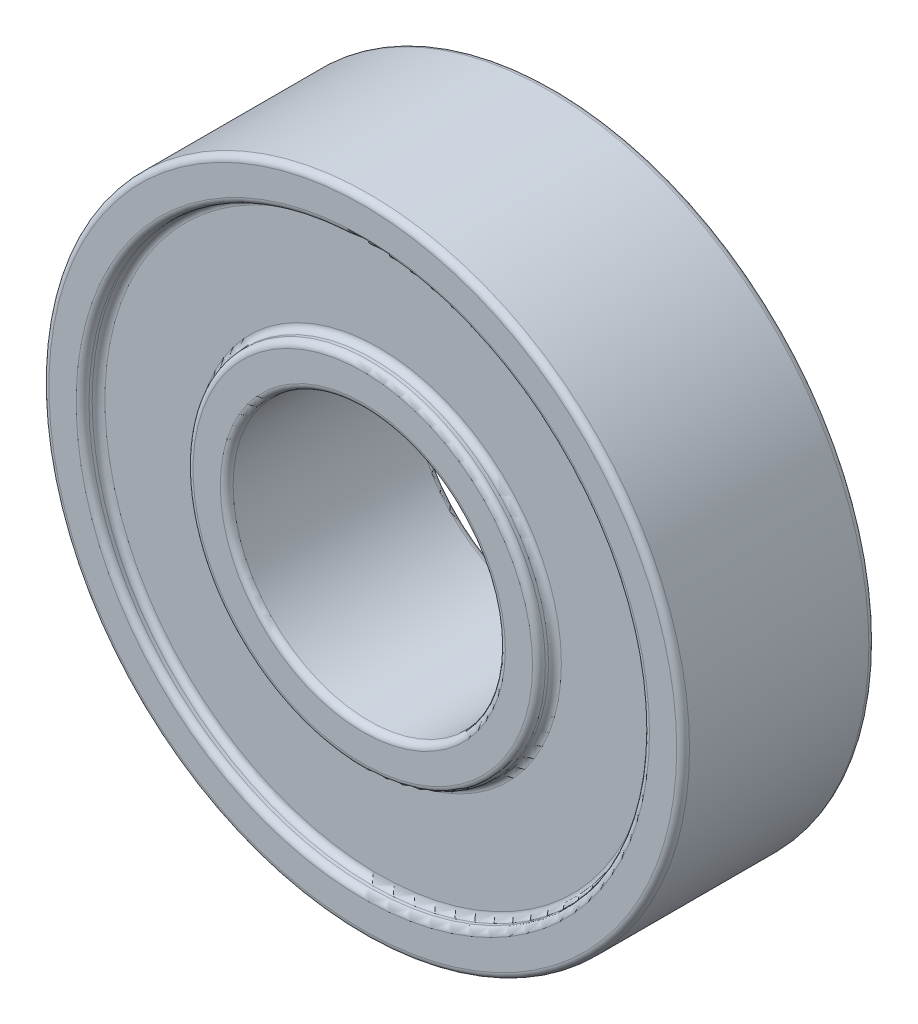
ISO-10303-21;
HEADER;
FILE_DESCRIPTION(('STEP AP214'),'2;1');
FILE_NAME('part.step','',(''),(''),'','','');
FILE_SCHEMA(('AUTOMOTIVE_DESIGN { 1 0 10303 214 1 1 1 1 }'));
ENDSEC;
DATA;
#1=APPLICATION_CONTEXT('core data for automotive mechanical design processes');
#2=APPLICATION_PROTOCOL_DEFINITION('international standard','automotive_design',2000,#1);
#3=PRODUCT_CONTEXT('',#1,'mechanical');
#4=PRODUCT('Part','Part','',(#3));
#5=PRODUCT_RELATED_PRODUCT_CATEGORY('part','',(#4));
#6=PRODUCT_DEFINITION_FORMATION('','',#4);
#7=PRODUCT_DEFINITION_CONTEXT('part definition',#1,'design');
#8=PRODUCT_DEFINITION('design','',#6,#7);
#9=PRODUCT_DEFINITION_SHAPE('','',#8);
#10=(LENGTH_UNIT() NAMED_UNIT(*) SI_UNIT(.MILLI.,.METRE.));
#11=(NAMED_UNIT(*) PLANE_ANGLE_UNIT() SI_UNIT($,.RADIAN.));
#12=(NAMED_UNIT(*) SI_UNIT($,.STERADIAN.) SOLID_ANGLE_UNIT());
#13=UNCERTAINTY_MEASURE_WITH_UNIT(LENGTH_MEASURE(1.E-05),#10,'distance_accuracy_value','');
#14=(GEOMETRIC_REPRESENTATION_CONTEXT(3) GLOBAL_UNCERTAINTY_ASSIGNED_CONTEXT((#13)) GLOBAL_UNIT_ASSIGNED_CONTEXT((#10,
#11,#12)) REPRESENTATION_CONTEXT('',''));
#15=CARTESIAN_POINT('',(0.,0.,0.));
#16=DIRECTION('',(0.,0.,1.));
#17=DIRECTION('',(1.,0.,0.));
#18=AXIS2_PLACEMENT_3D('',#15,#16,#17);
#19=CARTESIAN_POINT('',(0.,0.,0.));
#20=DIRECTION('',(0.,0.,1.));
#21=DIRECTION('',(1.,0.,0.));
#22=AXIS2_PLACEMENT_3D('',#19,#20,#21);
#23=PLANE('',#22);
#24=CARTESIAN_POINT('',(0.118835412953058,0.178253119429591,0.));
#25=DIRECTION('',(0.,0.,1.));
#26=DIRECTION('',(1.,0.,0.));
#27=AXIS2_PLACEMENT_3D('',#24,#25,#26);
#28=CIRCLE('',#27,10.6);
#29=CARTESIAN_POINT('',(10.7188354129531,0.178253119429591,0.));
#30=VERTEX_POINT('',#29);
#31=EDGE_CURVE('E74',#30,#30,#28,.F.);
#32=ORIENTED_EDGE('',*,*,#31,.T.);
#33=EDGE_LOOP('',(#32));
#34=FACE_BOUND('',#33,.T.);
#35=CARTESIAN_POINT('',(0.,0.,0.));
#36=DIRECTION('',(0.,0.,1.));
#37=DIRECTION('',(1.,0.,0.));
#38=AXIS2_PLACEMENT_3D('',#35,#36,#37);
#39=CIRCLE('',#38,8.9);
#40=CARTESIAN_POINT('',(8.9,0.,0.));
#41=VERTEX_POINT('',#40);
#42=EDGE_CURVE('E77',#41,#41,#39,.T.);
#43=ORIENTED_EDGE('',*,*,#42,.T.);
#44=EDGE_LOOP('',(#43));
#45=FACE_BOUND('',#44,.T.);
#46=ADVANCED_FACE('F30',(#34,#45),#23,.F.);
#47=CARTESIAN_POINT('',(0.,0.,12.));
#48=DIRECTION('',(0.,0.,1.));
#49=DIRECTION('',(1.,0.,0.));
#50=AXIS2_PLACEMENT_3D('',#47,#48,#49);
#51=PLANE('',#50);
#52=CARTESIAN_POINT('',(0.,0.,12.));
#53=DIRECTION('',(0.,0.,1.));
#54=DIRECTION('',(1.,0.,0.));
#55=AXIS2_PLACEMENT_3D('',#52,#53,#54);
#56=CIRCLE('',#55,10.6);
#57=CARTESIAN_POINT('',(10.6,0.,12.));
#58=VERTEX_POINT('',#57);
#59=EDGE_CURVE('E104',#58,#58,#56,.T.);
#60=ORIENTED_EDGE('',*,*,#59,.T.);
#61=EDGE_LOOP('',(#60));
#62=FACE_BOUND('',#61,.T.);
#63=CARTESIAN_POINT('',(0.,0.,12.));
#64=DIRECTION('',(0.,0.,1.));
#65=DIRECTION('',(1.,0.,0.));
#66=AXIS2_PLACEMENT_3D('',#63,#64,#65);
#67=CIRCLE('',#66,8.9);
#68=CARTESIAN_POINT('',(8.9,0.,12.));
#69=VERTEX_POINT('',#68);
#70=EDGE_CURVE('E107',#69,#69,#67,.F.);
#71=ORIENTED_EDGE('',*,*,#70,.T.);
#72=EDGE_LOOP('',(#71));
#73=FACE_BOUND('',#72,.T.);
#74=ADVANCED_FACE('F111',(#62,#73),#51,.T.);
#75=CARTESIAN_POINT('',(0.,0.,12.));
#76=DIRECTION('',(0.,0.,1.));
#77=DIRECTION('',(1.,0.,0.));
#78=AXIS2_PLACEMENT_3D('',#75,#76,#77);
#79=CIRCLE('',#78,17.9);
#80=CARTESIAN_POINT('',(17.9,0.,12.));
#81=VERTEX_POINT('',#80);
#82=EDGE_CURVE('E80',#81,#81,#79,.F.);
#83=ORIENTED_EDGE('',*,*,#82,.T.);
#84=EDGE_LOOP('',(#83));
#85=FACE_BOUND('',#84,.T.);
#86=CARTESIAN_POINT('',(0.,0.,12.));
#87=DIRECTION('',(0.,0.,1.));
#88=DIRECTION('',(1.,0.,0.));
#89=AXIS2_PLACEMENT_3D('',#86,#87,#88);
#90=CIRCLE('',#89,19.6);
#91=CARTESIAN_POINT('',(19.6,0.,12.));
#92=VERTEX_POINT('',#91);
#93=EDGE_CURVE('E83',#92,#92,#90,.T.);
#94=ORIENTED_EDGE('',*,*,#93,.T.);
#95=EDGE_LOOP('',(#94));
#96=FACE_BOUND('',#95,.T.);
#97=ADVANCED_FACE('F140',(#85,#96),#51,.T.);
#98=CARTESIAN_POINT('',(0.,0.,0.));
#99=DIRECTION('',(0.,0.,1.));
#100=DIRECTION('',(1.,0.,0.));
#101=AXIS2_PLACEMENT_3D('',#98,#99,#100);
#102=CIRCLE('',#101,17.9);
#103=CARTESIAN_POINT('',(17.9,0.,0.));
#104=VERTEX_POINT('',#103);
#105=EDGE_CURVE('E50',#104,#104,#102,.T.);
#106=ORIENTED_EDGE('',*,*,#105,.T.);
#107=EDGE_LOOP('',(#106));
#108=FACE_BOUND('',#107,.T.);
#109=CARTESIAN_POINT('',(0.,0.,0.));
#110=DIRECTION('',(0.,0.,1.));
#111=DIRECTION('',(1.,0.,0.));
#112=AXIS2_PLACEMENT_3D('',#109,#110,#111);
#113=CIRCLE('',#112,19.6);
#114=CARTESIAN_POINT('',(19.6,0.,0.));
#115=VERTEX_POINT('',#114);
#116=EDGE_CURVE('E53',#115,#115,#113,.F.);
#117=ORIENTED_EDGE('',*,*,#116,.T.);
#118=EDGE_LOOP('',(#117));
#119=FACE_BOUND('',#118,.T.);
#120=ADVANCED_FACE('F133',(#108,#119),#23,.F.);
#121=CARTESIAN_POINT('',(0.,0.,12.));
#122=DIRECTION('',(0.,0.,-1.));
#123=DIRECTION('',(-1.,0.,0.));
#124=AXIS2_PLACEMENT_3D('',#121,#122,#123);
#125=CYLINDRICAL_SURFACE('',#124,20.);
#126=CARTESIAN_POINT('',(0.,0.,0.399999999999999));
#127=DIRECTION('',(0.,0.,1.));
#128=DIRECTION('',(1.,0.,0.));
#129=AXIS2_PLACEMENT_3D('',#126,#127,#128);
#130=CIRCLE('',#129,20.);
#131=CARTESIAN_POINT('',(20.,0.,0.399999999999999));
#132=VERTEX_POINT('',#131);
#133=EDGE_CURVE('E10',#132,#132,#130,.T.);
#134=ORIENTED_EDGE('',*,*,#133,.T.);
#135=EDGE_LOOP('',(#134));
#136=FACE_BOUND('',#135,.T.);
#137=CARTESIAN_POINT('',(0.,0.,11.6));
#138=DIRECTION('',(0.,0.,1.));
#139=DIRECTION('',(1.,0.,0.));
#140=AXIS2_PLACEMENT_3D('',#137,#138,#139);
#141=CIRCLE('',#140,20.);
#142=CARTESIAN_POINT('',(20.,0.,11.6));
#143=VERTEX_POINT('',#142);
#144=EDGE_CURVE('E37',#143,#143,#141,.F.);
#145=ORIENTED_EDGE('',*,*,#144,.T.);
#146=EDGE_LOOP('',(#145));
#147=FACE_BOUND('',#146,.T.);
#148=ADVANCED_FACE('F32',(#136,#147),#125,.T.);
#149=CARTESIAN_POINT('',(0.,0.,12.));
#150=DIRECTION('',(0.,0.,-1.));
#151=DIRECTION('',(-1.,0.,0.));
#152=AXIS2_PLACEMENT_3D('',#149,#150,#151);
#153=CYLINDRICAL_SURFACE('',#152,8.5);
#154=CARTESIAN_POINT('',(0.,0.,0.399999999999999));
#155=DIRECTION('',(0.,0.,1.));
#156=DIRECTION('',(1.,0.,0.));
#157=AXIS2_PLACEMENT_3D('',#154,#155,#156);
#158=CIRCLE('',#157,8.5);
#159=CARTESIAN_POINT('',(8.5,0.,0.399999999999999));
#160=VERTEX_POINT('',#159);
#161=EDGE_CURVE('E41',#160,#160,#158,.F.);
#162=ORIENTED_EDGE('',*,*,#161,.T.);
#163=EDGE_LOOP('',(#162));
#164=FACE_BOUND('',#163,.T.);
#165=CARTESIAN_POINT('',(0.,0.,11.6));
#166=DIRECTION('',(0.,0.,1.));
#167=DIRECTION('',(1.,0.,0.));
#168=AXIS2_PLACEMENT_3D('',#165,#166,#167);
#169=CIRCLE('',#168,8.5);
#170=CARTESIAN_POINT('',(8.5,0.,11.6));
#171=VERTEX_POINT('',#170);
#172=EDGE_CURVE('E45',#171,#171,#169,.T.);
#173=ORIENTED_EDGE('',*,*,#172,.T.);
#174=EDGE_LOOP('',(#173));
#175=FACE_BOUND('',#174,.T.);
#176=ADVANCED_FACE('F121',(#164,#175),#153,.F.);
#177=CARTESIAN_POINT('',(0.,0.,11.));
#178=DIRECTION('',(0.,0.,1.));
#179=DIRECTION('',(1.,0.,0.));
#180=AXIS2_PLACEMENT_3D('',#177,#178,#179);
#181=CYLINDRICAL_SURFACE('',#180,17.5);
#182=CARTESIAN_POINT('',(0.,0.,11.6));
#183=DIRECTION('',(0.,0.,1.));
#184=DIRECTION('',(1.,0.,0.));
#185=AXIS2_PLACEMENT_3D('',#182,#183,#184);
#186=CIRCLE('',#185,17.5);
#187=CARTESIAN_POINT('',(17.5,0.,11.6));
#188=VERTEX_POINT('',#187);
#189=EDGE_CURVE('E86',#188,#188,#186,.T.);
#190=ORIENTED_EDGE('',*,*,#189,.T.);
#191=EDGE_LOOP('',(#190));
#192=FACE_BOUND('',#191,.T.);
#193=CARTESIAN_POINT('',(0.,0.,11.4));
#194=DIRECTION('',(0.,0.,1.));
#195=DIRECTION('',(1.,0.,0.));
#196=AXIS2_PLACEMENT_3D('',#193,#194,#195);
#197=CIRCLE('',#196,17.5);
#198=CARTESIAN_POINT('',(17.5,0.,11.4));
#199=VERTEX_POINT('',#198);
#200=EDGE_CURVE('E89',#199,#199,#197,.F.);
#201=ORIENTED_EDGE('',*,*,#200,.T.);
#202=EDGE_LOOP('',(#201));
#203=FACE_BOUND('',#202,.T.);
#204=ADVANCED_FACE('F123',(#192,#203),#181,.F.);
#205=CARTESIAN_POINT('',(0.,0.,11.));
#206=DIRECTION('',(0.,0.,1.));
#207=DIRECTION('',(1.,0.,0.));
#208=AXIS2_PLACEMENT_3D('',#205,#206,#207);
#209=PLANE('',#208);
#210=CARTESIAN_POINT('',(0.,0.,11.));
#211=DIRECTION('',(0.,0.,1.));
#212=DIRECTION('',(1.,0.,0.));
#213=AXIS2_PLACEMENT_3D('',#210,#211,#212);
#214=CIRCLE('',#213,11.4);
#215=CARTESIAN_POINT('',(11.4,0.,11.));
#216=VERTEX_POINT('',#215);
#217=EDGE_CURVE('E92',#216,#216,#214,.F.);
#218=ORIENTED_EDGE('',*,*,#217,.T.);
#219=EDGE_LOOP('',(#218));
#220=FACE_BOUND('',#219,.T.);
#221=CARTESIAN_POINT('',(0.,0.,11.));
#222=DIRECTION('',(0.,0.,1.));
#223=DIRECTION('',(1.,0.,0.));
#224=AXIS2_PLACEMENT_3D('',#221,#222,#223);
#225=CIRCLE('',#224,17.1);
#226=CARTESIAN_POINT('',(17.1,0.,11.));
#227=VERTEX_POINT('',#226);
#228=EDGE_CURVE('E95',#227,#227,#225,.T.);
#229=ORIENTED_EDGE('',*,*,#228,.T.);
#230=EDGE_LOOP('',(#229));
#231=FACE_BOUND('',#230,.T.);
#232=ADVANCED_FACE('F130',(#220,#231),#209,.T.);
#233=CARTESIAN_POINT('',(0.,0.,11.));
#234=DIRECTION('',(0.,0.,1.));
#235=DIRECTION('',(1.,0.,0.));
#236=AXIS2_PLACEMENT_3D('',#233,#234,#235);
#237=CYLINDRICAL_SURFACE('',#236,11.);
#238=CARTESIAN_POINT('',(0.,0.,11.6));
#239=DIRECTION('',(0.,0.,1.));
#240=DIRECTION('',(1.,0.,0.));
#241=AXIS2_PLACEMENT_3D('',#238,#239,#240);
#242=CIRCLE('',#241,11.);
#243=CARTESIAN_POINT('',(11.,0.,11.6));
#244=VERTEX_POINT('',#243);
#245=EDGE_CURVE('E98',#244,#244,#242,.F.);
#246=ORIENTED_EDGE('',*,*,#245,.T.);
#247=EDGE_LOOP('',(#246));
#248=FACE_BOUND('',#247,.T.);
#249=CARTESIAN_POINT('',(0.,0.,11.4));
#250=DIRECTION('',(0.,0.,1.));
#251=DIRECTION('',(1.,0.,0.));
#252=AXIS2_PLACEMENT_3D('',#249,#250,#251);
#253=CIRCLE('',#252,11.);
#254=CARTESIAN_POINT('',(11.,0.,11.4));
#255=VERTEX_POINT('',#254);
#256=EDGE_CURVE('E101',#255,#255,#253,.T.);
#257=ORIENTED_EDGE('',*,*,#256,.T.);
#258=EDGE_LOOP('',(#257));
#259=FACE_BOUND('',#258,.T.);
#260=ADVANCED_FACE('F209',(#248,#259),#237,.T.);
#261=CARTESIAN_POINT('',(0.,0.,1.));
#262=DIRECTION('',(0.,0.,-1.));
#263=DIRECTION('',(-1.,0.,0.));
#264=AXIS2_PLACEMENT_3D('',#261,#262,#263);
#265=CYLINDRICAL_SURFACE('',#264,17.5);
#266=CARTESIAN_POINT('',(0.,0.,0.4));
#267=DIRECTION('',(0.,0.,1.));
#268=DIRECTION('',(1.,0.,0.));
#269=AXIS2_PLACEMENT_3D('',#266,#267,#268);
#270=CIRCLE('',#269,17.5);
#271=CARTESIAN_POINT('',(17.5,0.,0.4));
#272=VERTEX_POINT('',#271);
#273=EDGE_CURVE('E56',#272,#272,#270,.F.);
#274=ORIENTED_EDGE('',*,*,#273,.T.);
#275=EDGE_LOOP('',(#274));
#276=FACE_BOUND('',#275,.T.);
#277=CARTESIAN_POINT('',(0.,0.,0.6));
#278=DIRECTION('',(0.,0.,-1.));
#279=DIRECTION('',(-1.,0.,0.));
#280=AXIS2_PLACEMENT_3D('',#277,#278,#279);
#281=CIRCLE('',#280,17.5);
#282=CARTESIAN_POINT('',(-17.5,0.,0.6));
#283=VERTEX_POINT('',#282);
#284=EDGE_CURVE('E59',#283,#283,#281,.F.);
#285=ORIENTED_EDGE('',*,*,#284,.T.);
#286=EDGE_LOOP('',(#285));
#287=FACE_BOUND('',#286,.T.);
#288=ADVANCED_FACE('F205',(#276,#287),#265,.F.);
#289=CARTESIAN_POINT('',(0.,0.,1.));
#290=DIRECTION('',(0.,0.,-1.));
#291=DIRECTION('',(-1.,0.,0.));
#292=AXIS2_PLACEMENT_3D('',#289,#290,#291);
#293=PLANE('',#292);
#294=CARTESIAN_POINT('',(0.118835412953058,0.178253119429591,1.));
#295=DIRECTION('',(0.,0.,-1.));
#296=DIRECTION('',(-1.,0.,0.));
#297=AXIS2_PLACEMENT_3D('',#294,#295,#296);
#298=CIRCLE('',#297,11.4);
#299=CARTESIAN_POINT('',(-11.2811645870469,0.178253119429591,1.));
#300=VERTEX_POINT('',#299);
#301=EDGE_CURVE('E62',#300,#300,#298,.F.);
#302=ORIENTED_EDGE('',*,*,#301,.T.);
#303=EDGE_LOOP('',(#302));
#304=FACE_BOUND('',#303,.T.);
#305=CARTESIAN_POINT('',(0.,0.,1.));
#306=DIRECTION('',(0.,0.,-1.));
#307=DIRECTION('',(-1.,0.,0.));
#308=AXIS2_PLACEMENT_3D('',#305,#306,#307);
#309=CIRCLE('',#308,17.1);
#310=CARTESIAN_POINT('',(-17.1,0.,1.));
#311=VERTEX_POINT('',#310);
#312=EDGE_CURVE('E65',#311,#311,#309,.T.);
#313=ORIENTED_EDGE('',*,*,#312,.T.);
#314=EDGE_LOOP('',(#313));
#315=FACE_BOUND('',#314,.T.);
#316=ADVANCED_FACE('F201',(#304,#315),#293,.T.);
#317=CARTESIAN_POINT('',(0.118835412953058,0.178253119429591,1.));
#318=DIRECTION('',(0.,0.,-1.));
#319=DIRECTION('',(-1.,0.,0.));
#320=AXIS2_PLACEMENT_3D('',#317,#318,#319);
#321=CYLINDRICAL_SURFACE('',#320,11.);
#322=CARTESIAN_POINT('',(0.118835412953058,0.178253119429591,0.4));
#323=DIRECTION('',(0.,0.,1.));
#324=DIRECTION('',(1.,0.,0.));
#325=AXIS2_PLACEMENT_3D('',#322,#323,#324);
#326=CIRCLE('',#325,11.);
#327=CARTESIAN_POINT('',(11.1188354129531,0.178253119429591,0.4));
#328=VERTEX_POINT('',#327);
#329=EDGE_CURVE('E68',#328,#328,#326,.T.);
#330=ORIENTED_EDGE('',*,*,#329,.T.);
#331=EDGE_LOOP('',(#330));
#332=FACE_BOUND('',#331,.T.);
#333=CARTESIAN_POINT('',(0.118835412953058,0.178253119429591,0.6));
#334=DIRECTION('',(0.,0.,-1.));
#335=DIRECTION('',(-1.,0.,0.));
#336=AXIS2_PLACEMENT_3D('',#333,#334,#335);
#337=CIRCLE('',#336,11.);
#338=CARTESIAN_POINT('',(-10.8811645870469,0.178253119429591,0.6));
#339=VERTEX_POINT('',#338);
#340=EDGE_CURVE('E71',#339,#339,#337,.T.);
#341=ORIENTED_EDGE('',*,*,#340,.T.);
#342=EDGE_LOOP('',(#341));
#343=FACE_BOUND('',#342,.T.);
#344=ADVANCED_FACE('F197',(#332,#343),#321,.T.);
#345=CARTESIAN_POINT('',(0.,0.,11.6));
#346=DIRECTION('',(0.,0.,1.));
#347=DIRECTION('',(1.,0.,0.));
#348=AXIS2_PLACEMENT_3D('',#345,#346,#347);
#349=TOROIDAL_SURFACE('',#348,10.6,0.4);
#350=ORIENTED_EDGE('',*,*,#245,.F.);
#351=EDGE_LOOP('',(#350));
#352=FACE_BOUND('',#351,.T.);
#353=ORIENTED_EDGE('',*,*,#59,.F.);
#354=EDGE_LOOP('',(#353));
#355=FACE_BOUND('',#354,.T.);
#356=ADVANCED_FACE('F193',(#352,#355),#349,.T.);
#357=CARTESIAN_POINT('',(0.,0.,11.4));
#358=DIRECTION('',(0.,0.,1.));
#359=DIRECTION('',(1.,0.,0.));
#360=AXIS2_PLACEMENT_3D('',#357,#358,#359);
#361=TOROIDAL_SURFACE('',#360,11.4,0.4);
#362=ORIENTED_EDGE('',*,*,#217,.F.);
#363=EDGE_LOOP('',(#362));
#364=FACE_BOUND('',#363,.T.);
#365=ORIENTED_EDGE('',*,*,#256,.F.);
#366=EDGE_LOOP('',(#365));
#367=FACE_BOUND('',#366,.T.);
#368=ADVANCED_FACE('F189',(#364,#367),#361,.F.);
#369=CARTESIAN_POINT('',(0.,0.,11.6));
#370=DIRECTION('',(0.,0.,1.));
#371=DIRECTION('',(1.,0.,0.));
#372=AXIS2_PLACEMENT_3D('',#369,#370,#371);
#373=TOROIDAL_SURFACE('',#372,17.9,0.4);
#374=ORIENTED_EDGE('',*,*,#82,.F.);
#375=EDGE_LOOP('',(#374));
#376=FACE_BOUND('',#375,.T.);
#377=ORIENTED_EDGE('',*,*,#189,.F.);
#378=EDGE_LOOP('',(#377));
#379=FACE_BOUND('',#378,.T.);
#380=ADVANCED_FACE('F185',(#376,#379),#373,.T.);
#381=CARTESIAN_POINT('',(0.,0.,11.4));
#382=DIRECTION('',(0.,0.,1.));
#383=DIRECTION('',(1.,0.,0.));
#384=AXIS2_PLACEMENT_3D('',#381,#382,#383);
#385=TOROIDAL_SURFACE('',#384,17.1,0.4);
#386=ORIENTED_EDGE('',*,*,#200,.F.);
#387=EDGE_LOOP('',(#386));
#388=FACE_BOUND('',#387,.T.);
#389=ORIENTED_EDGE('',*,*,#228,.F.);
#390=EDGE_LOOP('',(#389));
#391=FACE_BOUND('',#390,.T.);
#392=ADVANCED_FACE('F181',(#388,#391),#385,.F.);
#393=CARTESIAN_POINT('',(0.118835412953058,0.178253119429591,0.4));
#394=DIRECTION('',(0.,0.,1.));
#395=DIRECTION('',(1.,0.,0.));
#396=AXIS2_PLACEMENT_3D('',#393,#394,#395);
#397=TOROIDAL_SURFACE('',#396,10.6,0.4);
#398=ORIENTED_EDGE('',*,*,#329,.F.);
#399=EDGE_LOOP('',(#398));
#400=FACE_BOUND('',#399,.T.);
#401=ORIENTED_EDGE('',*,*,#31,.F.);
#402=EDGE_LOOP('',(#401));
#403=FACE_BOUND('',#402,.T.);
#404=ADVANCED_FACE('F177',(#400,#403),#397,.T.);
#405=CARTESIAN_POINT('',(0.118835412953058,0.178253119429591,0.6));
#406=DIRECTION('',(0.,0.,-1.));
#407=DIRECTION('',(-1.,0.,0.));
#408=AXIS2_PLACEMENT_3D('',#405,#406,#407);
#409=TOROIDAL_SURFACE('',#408,11.4,0.4);
#410=ORIENTED_EDGE('',*,*,#301,.F.);
#411=EDGE_LOOP('',(#410));
#412=FACE_BOUND('',#411,.T.);
#413=ORIENTED_EDGE('',*,*,#340,.F.);
#414=EDGE_LOOP('',(#413));
#415=FACE_BOUND('',#414,.T.);
#416=ADVANCED_FACE('F173',(#412,#415),#409,.F.);
#417=CARTESIAN_POINT('',(0.,0.,0.4));
#418=DIRECTION('',(0.,0.,1.));
#419=DIRECTION('',(1.,0.,0.));
#420=AXIS2_PLACEMENT_3D('',#417,#418,#419);
#421=TOROIDAL_SURFACE('',#420,17.9,0.4);
#422=ORIENTED_EDGE('',*,*,#105,.F.);
#423=EDGE_LOOP('',(#422));
#424=FACE_BOUND('',#423,.T.);
#425=ORIENTED_EDGE('',*,*,#273,.F.);
#426=EDGE_LOOP('',(#425));
#427=FACE_BOUND('',#426,.T.);
#428=ADVANCED_FACE('F169',(#424,#427),#421,.T.);
#429=CARTESIAN_POINT('',(0.,0.,0.6));
#430=DIRECTION('',(0.,0.,-1.));
#431=DIRECTION('',(-1.,0.,0.));
#432=AXIS2_PLACEMENT_3D('',#429,#430,#431);
#433=TOROIDAL_SURFACE('',#432,17.1,0.4);
#434=ORIENTED_EDGE('',*,*,#284,.F.);
#435=EDGE_LOOP('',(#434));
#436=FACE_BOUND('',#435,.T.);
#437=ORIENTED_EDGE('',*,*,#312,.F.);
#438=EDGE_LOOP('',(#437));
#439=FACE_BOUND('',#438,.T.);
#440=ADVANCED_FACE('F165',(#436,#439),#433,.F.);
#441=CARTESIAN_POINT('',(0.,0.,0.399999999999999));
#442=DIRECTION('',(0.,0.,1.));
#443=DIRECTION('',(1.,0.,0.));
#444=AXIS2_PLACEMENT_3D('',#441,#442,#443);
#445=TOROIDAL_SURFACE('',#444,8.9,0.4);
#446=ORIENTED_EDGE('',*,*,#161,.F.);
#447=EDGE_LOOP('',(#446));
#448=FACE_BOUND('',#447,.T.);
#449=ORIENTED_EDGE('',*,*,#42,.F.);
#450=EDGE_LOOP('',(#449));
#451=FACE_BOUND('',#450,.T.);
#452=ADVANCED_FACE('F117',(#448,#451),#445,.T.);
#453=CARTESIAN_POINT('',(0.,0.,11.6));
#454=DIRECTION('',(0.,0.,1.));
#455=DIRECTION('',(1.,0.,0.));
#456=AXIS2_PLACEMENT_3D('',#453,#454,#455);
#457=TOROIDAL_SURFACE('',#456,8.9,0.4);
#458=ORIENTED_EDGE('',*,*,#70,.F.);
#459=EDGE_LOOP('',(#458));
#460=FACE_BOUND('',#459,.T.);
#461=ORIENTED_EDGE('',*,*,#172,.F.);
#462=EDGE_LOOP('',(#461));
#463=FACE_BOUND('',#462,.T.);
#464=ADVANCED_FACE('F113',(#460,#463),#457,.T.);
#465=CARTESIAN_POINT('',(0.,0.,0.399999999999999));
#466=DIRECTION('',(0.,0.,1.));
#467=DIRECTION('',(1.,0.,0.));
#468=AXIS2_PLACEMENT_3D('',#465,#466,#467);
#469=TOROIDAL_SURFACE('',#468,19.6,0.4);
#470=ORIENTED_EDGE('',*,*,#116,.F.);
#471=EDGE_LOOP('',(#470));
#472=FACE_BOUND('',#471,.T.);
#473=ORIENTED_EDGE('',*,*,#133,.F.);
#474=EDGE_LOOP('',(#473));
#475=FACE_BOUND('',#474,.T.);
#476=ADVANCED_FACE('F116',(#472,#475),#469,.T.);
#477=CARTESIAN_POINT('',(0.,0.,11.6));
#478=DIRECTION('',(0.,0.,1.));
#479=DIRECTION('',(1.,0.,0.));
#480=AXIS2_PLACEMENT_3D('',#477,#478,#479);
#481=TOROIDAL_SURFACE('',#480,19.6,0.4);
#482=ORIENTED_EDGE('',*,*,#144,.F.);
#483=EDGE_LOOP('',(#482));
#484=FACE_BOUND('',#483,.T.);
#485=ORIENTED_EDGE('',*,*,#93,.F.);
#486=EDGE_LOOP('',(#485));
#487=FACE_BOUND('',#486,.T.);
#488=ADVANCED_FACE('F155',(#484,#487),#481,.T.);
#489=CLOSED_SHELL('',(#46,#74,#97,#120,#148,#176,#204,#232,#260,#288,#316,#344,#356,#368,#380,
#392,#404,#416,#428,#440,#452,#464,#476,#488));
#490=MANIFOLD_SOLID_BREP('B2',#489);
#491=ADVANCED_BREP_SHAPE_REPRESENTATION('',(#18,#490),#14);
#492=SHAPE_DEFINITION_REPRESENTATION(#9,#491);
ENDSEC;
END-ISO-10303-21;
